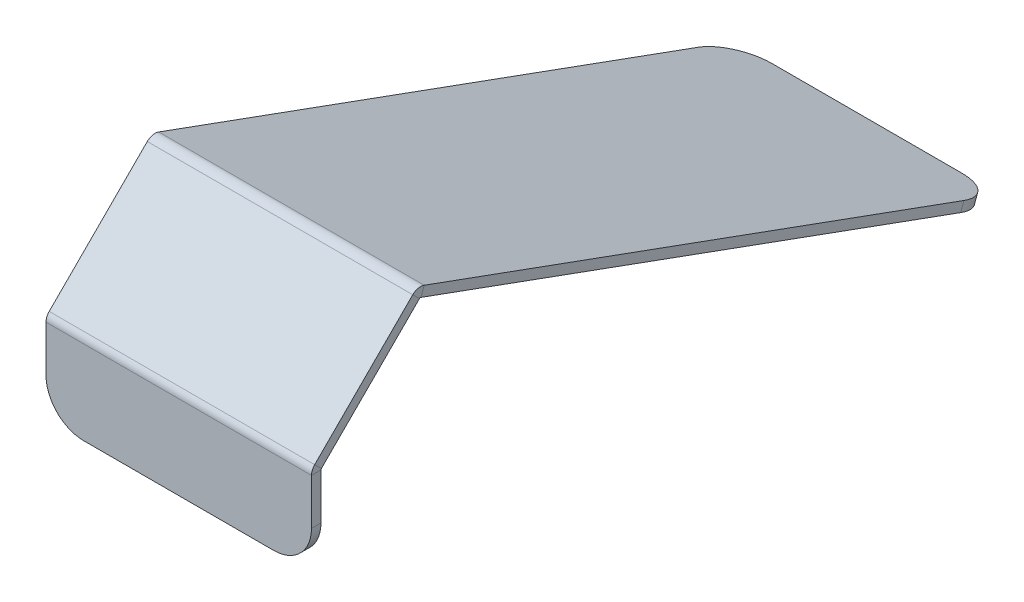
ISO-10303-21;
HEADER;
FILE_DESCRIPTION(('STEP AP214'),'2;1');
FILE_NAME('part.step','',(''),(''),'','','');
FILE_SCHEMA(('AUTOMOTIVE_DESIGN { 1 0 10303 214 1 1 1 1 }'));
ENDSEC;
DATA;
#1=APPLICATION_CONTEXT('core data for automotive mechanical design processes');
#2=APPLICATION_PROTOCOL_DEFINITION('international standard','automotive_design',2000,#1);
#3=PRODUCT_CONTEXT('',#1,'mechanical');
#4=PRODUCT('Part','Part','',(#3));
#5=PRODUCT_RELATED_PRODUCT_CATEGORY('part','',(#4));
#6=PRODUCT_DEFINITION_FORMATION('','',#4);
#7=PRODUCT_DEFINITION_CONTEXT('part definition',#1,'design');
#8=PRODUCT_DEFINITION('design','',#6,#7);
#9=PRODUCT_DEFINITION_SHAPE('','',#8);
#10=(LENGTH_UNIT() NAMED_UNIT(*) SI_UNIT(.MILLI.,.METRE.));
#11=(NAMED_UNIT(*) PLANE_ANGLE_UNIT() SI_UNIT($,.RADIAN.));
#12=(NAMED_UNIT(*) SI_UNIT($,.STERADIAN.) SOLID_ANGLE_UNIT());
#13=UNCERTAINTY_MEASURE_WITH_UNIT(LENGTH_MEASURE(1.E-05),#10,'distance_accuracy_value','');
#14=(GEOMETRIC_REPRESENTATION_CONTEXT(3) GLOBAL_UNCERTAINTY_ASSIGNED_CONTEXT((#13)) GLOBAL_UNIT_ASSIGNED_CONTEXT((#10,
#11,#12)) REPRESENTATION_CONTEXT('',''));
#15=CARTESIAN_POINT('',(0.,0.,0.));
#16=DIRECTION('',(0.,0.,1.));
#17=DIRECTION('',(1.,0.,0.));
#18=AXIS2_PLACEMENT_3D('',#15,#16,#17);
#19=CARTESIAN_POINT('',(-70.,330.936458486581,-279.331290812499));
#20=DIRECTION('',(1.,0.,0.));
#21=DIRECTION('',(0.,0.707106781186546,-0.707106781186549));
#22=AXIS2_PLACEMENT_3D('',#19,#20,#21);
#23=PLANE('',#22);
#24=DIRECTION('',(0.,-0.707106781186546,0.707106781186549));
#25=VECTOR('',#24,1.);
#26=CARTESIAN_POINT('',(-70.,330.936458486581,-279.331290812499));
#27=LINE('',#26,#25);
#28=CARTESIAN_POINT('',(-70.,100.020207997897,-48.4150402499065));
#29=VERTEX_POINT('',#28);
#30=CARTESIAN_POINT('',(-70.,48.2853789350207,3.31978878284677));
#31=VERTEX_POINT('',#30);
#32=EDGE_CURVE('E266',#29,#31,#27,.T.);
#33=ORIENTED_EDGE('',*,*,#32,.F.);
#34=DIRECTION('',(0.,-0.707106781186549,-0.707106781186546));
#35=VECTOR('',#34,1.);
#36=CARTESIAN_POINT('',(-70.,100.020207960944,-48.4150402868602));
#37=LINE('',#36,#35);
#38=CARTESIAN_POINT('',(-70.,96.4846740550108,-51.950574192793));
#39=VERTEX_POINT('',#38);
#40=EDGE_CURVE('E258',#29,#39,#37,.T.);
#41=ORIENTED_EDGE('',*,*,#40,.T.);
#42=DIRECTION('',(0.,-0.707106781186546,0.707106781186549));
#43=VECTOR('',#42,1.);
#44=CARTESIAN_POINT('',(-70.,327.400924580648,-282.866824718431));
#45=LINE('',#44,#43);
#46=CARTESIAN_POINT('',(-70.,44.7498450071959,-0.215745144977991));
#47=VERTEX_POINT('',#46);
#48=EDGE_CURVE('E216',#39,#47,#45,.T.);
#49=ORIENTED_EDGE('',*,*,#48,.T.);
#50=DIRECTION('',(0.,0.707106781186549,0.707106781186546));
#51=VECTOR('',#50,1.);
#52=CARTESIAN_POINT('',(-70.,48.2853789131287,3.31978876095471));
#53=LINE('',#52,#51);
#54=EDGE_CURVE('E241',#47,#31,#53,.T.);
#55=ORIENTED_EDGE('',*,*,#54,.T.);
#56=EDGE_LOOP('',(#33,#41,#49,#55));
#57=FACE_BOUND('',#56,.T.);
#58=ADVANCED_FACE('F40',(#57),#23,.F.);
#59=CARTESIAN_POINT('',(70.,330.936458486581,-279.331290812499));
#60=DIRECTION('',(-1.,0.,0.));
#61=DIRECTION('',(0.,-0.707106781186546,0.707106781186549));
#62=AXIS2_PLACEMENT_3D('',#59,#60,#61);
#63=PLANE('',#62);
#64=DIRECTION('',(0.,0.707106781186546,-0.707106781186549));
#65=VECTOR('',#64,1.);
#66=CARTESIAN_POINT('',(70.,327.400924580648,-282.866824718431));
#67=LINE('',#66,#65);
#68=CARTESIAN_POINT('',(70.,44.7498450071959,-0.215745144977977));
#69=VERTEX_POINT('',#68);
#70=CARTESIAN_POINT('',(70.,96.4846741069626,-51.9505741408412));
#71=VERTEX_POINT('',#70);
#72=EDGE_CURVE('E263',#69,#71,#67,.T.);
#73=ORIENTED_EDGE('',*,*,#72,.T.);
#74=DIRECTION('',(0.,0.707106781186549,0.707106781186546));
#75=VECTOR('',#74,1.);
#76=CARTESIAN_POINT('',(70.,100.020207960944,-48.4150402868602));
#77=LINE('',#76,#75);
#78=CARTESIAN_POINT('',(70.,100.020208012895,-48.4150402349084));
#79=VERTEX_POINT('',#78);
#80=EDGE_CURVE('E252',#71,#79,#77,.T.);
#81=ORIENTED_EDGE('',*,*,#80,.T.);
#82=DIRECTION('',(0.,0.707106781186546,-0.707106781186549));
#83=VECTOR('',#82,1.);
#84=CARTESIAN_POINT('',(70.,330.936458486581,-279.331290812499));
#85=LINE('',#84,#83);
#86=CARTESIAN_POINT('',(70.,48.2853789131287,3.31978876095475));
#87=VERTEX_POINT('',#86);
#88=EDGE_CURVE('E242',#87,#79,#85,.T.);
#89=ORIENTED_EDGE('',*,*,#88,.F.);
#90=DIRECTION('',(0.,-0.707106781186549,-0.707106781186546));
#91=VECTOR('',#90,1.);
#92=CARTESIAN_POINT('',(70.,48.2853789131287,3.31978876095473));
#93=LINE('',#92,#91);
#94=EDGE_CURVE('E248',#87,#69,#93,.T.);
#95=ORIENTED_EDGE('',*,*,#94,.T.);
#96=EDGE_LOOP('',(#73,#81,#89,#95));
#97=FACE_BOUND('',#96,.T.);
#98=ADVANCED_FACE('F339',(#97),#63,.F.);
#99=CARTESIAN_POINT('',(-70.,11.6777467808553,32.8563530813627));
#100=DIRECTION('',(0.,0.707106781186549,0.707106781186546));
#101=DIRECTION('',(1.,0.,0.));
#102=AXIS2_PLACEMENT_3D('',#99,#100,#101);
#103=PLANE('',#102);
#104=ORIENTED_EDGE('',*,*,#48,.F.);
#105=DIRECTION('',(1.,0.,0.));
#106=VECTOR('',#105,1.);
#107=CARTESIAN_POINT('',(-70.,96.4846740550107,-51.950574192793));
#108=LINE('',#107,#106);
#109=EDGE_CURVE('E255',#39,#71,#108,.T.);
#110=ORIENTED_EDGE('',*,*,#109,.T.);
#111=ORIENTED_EDGE('',*,*,#72,.F.);
#112=DIRECTION('',(-1.,0.,0.));
#113=VECTOR('',#112,1.);
#114=CARTESIAN_POINT('',(-70.,44.7498450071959,-0.215745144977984));
#115=LINE('',#114,#113);
#116=EDGE_CURVE('E245',#69,#47,#115,.T.);
#117=ORIENTED_EDGE('',*,*,#116,.T.);
#118=EDGE_LOOP('',(#104,#110,#111,#117));
#119=FACE_BOUND('',#118,.T.);
#120=ADVANCED_FACE('F358',(#119),#103,.F.);
#121=CARTESIAN_POINT('',(-70.,15.2132806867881,36.3918869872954));
#122=DIRECTION('',(0.,0.707106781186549,0.707106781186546));
#123=DIRECTION('',(1.,0.,0.));
#124=AXIS2_PLACEMENT_3D('',#121,#122,#123);
#125=PLANE('',#124);
#126=DIRECTION('',(1.,0.,0.));
#127=VECTOR('',#126,1.);
#128=CARTESIAN_POINT('',(-70.,100.020207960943,-48.4150402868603));
#129=LINE('',#128,#127);
#130=EDGE_CURVE('E191',#29,#79,#129,.T.);
#131=ORIENTED_EDGE('',*,*,#130,.F.);
#132=ORIENTED_EDGE('',*,*,#32,.T.);
#133=DIRECTION('',(-1.,0.,0.));
#134=VECTOR('',#133,1.);
#135=CARTESIAN_POINT('',(-70.,48.2853789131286,3.31978876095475));
#136=LINE('',#135,#134);
#137=EDGE_CURVE('E238',#87,#31,#136,.T.);
#138=ORIENTED_EDGE('',*,*,#137,.F.);
#139=ORIENTED_EDGE('',*,*,#88,.T.);
#140=EDGE_LOOP('',(#131,#132,#138,#139));
#141=FACE_BOUND('',#140,.T.);
#142=ADVANCED_FACE('F336',(#141),#125,.T.);
#143=CARTESIAN_POINT('',(-70.,0.,5.));
#144=DIRECTION('',(0.,1.,0.));
#145=DIRECTION('',(0.,0.,1.));
#146=AXIS2_PLACEMENT_3D('',#143,#144,#145);
#147=PLANE('',#146);
#148=DIRECTION('',(1.,0.,0.));
#149=VECTOR('',#148,1.);
#150=CARTESIAN_POINT('',(-70.,0.,0.));
#151=LINE('',#150,#149);
#152=CARTESIAN_POINT('',(-50.,0.,0.));
#153=VERTEX_POINT('',#152);
#154=CARTESIAN_POINT('',(50.,0.,0.));
#155=VERTEX_POINT('',#154);
#156=EDGE_CURVE('E228',#153,#155,#151,.T.);
#157=ORIENTED_EDGE('',*,*,#156,.T.);
#158=DIRECTION('',(0.,0.,-1.));
#159=VECTOR('',#158,1.);
#160=CARTESIAN_POINT('',(50.,0.,5.));
#161=LINE('',#160,#159);
#162=CARTESIAN_POINT('',(50.,0.,5.));
#163=VERTEX_POINT('',#162);
#164=EDGE_CURVE('E61',#155,#163,#161,.F.);
#165=ORIENTED_EDGE('',*,*,#164,.T.);
#166=DIRECTION('',(1.,0.,0.));
#167=VECTOR('',#166,1.);
#168=CARTESIAN_POINT('',(-70.,0.,5.));
#169=LINE('',#168,#167);
#170=CARTESIAN_POINT('',(-50.,0.,5.));
#171=VERTEX_POINT('',#170);
#172=EDGE_CURVE('E219',#171,#163,#169,.T.);
#173=ORIENTED_EDGE('',*,*,#172,.F.);
#174=DIRECTION('',(0.,0.,-1.));
#175=VECTOR('',#174,1.);
#176=CARTESIAN_POINT('',(-50.,0.,5.));
#177=LINE('',#176,#175);
#178=EDGE_CURVE('E292',#171,#153,#177,.T.);
#179=ORIENTED_EDGE('',*,*,#178,.T.);
#180=EDGE_LOOP('',(#157,#165,#173,#179));
#181=FACE_BOUND('',#180,.T.);
#182=ADVANCED_FACE('F313',(#181),#147,.F.);
#183=CARTESIAN_POINT('',(-70.,0.,5.));
#184=DIRECTION('',(0.,0.,1.));
#185=DIRECTION('',(1.,0.,0.));
#186=AXIS2_PLACEMENT_3D('',#183,#184,#185);
#187=PLANE('',#186);
#188=ORIENTED_EDGE('',*,*,#172,.T.);
#189=CARTESIAN_POINT('',(50.,20.,5.));
#190=DIRECTION('',(0.,0.,1.));
#191=DIRECTION('',(1.,0.,0.));
#192=AXIS2_PLACEMENT_3D('',#189,#190,#191);
#193=CIRCLE('',#192,20.);
#194=CARTESIAN_POINT('',(70.,20.,5.));
#195=VERTEX_POINT('',#194);
#196=EDGE_CURVE('E48',#163,#195,#193,.T.);
#197=ORIENTED_EDGE('',*,*,#196,.T.);
#198=DIRECTION('',(0.,1.,0.));
#199=VECTOR('',#198,1.);
#200=CARTESIAN_POINT('',(69.9999999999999,446.5,5.));
#201=LINE('',#200,#199);
#202=CARTESIAN_POINT('',(70.,44.2289901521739,5.));
#203=VERTEX_POINT('',#202);
#204=EDGE_CURVE('E226',#195,#203,#201,.T.);
#205=ORIENTED_EDGE('',*,*,#204,.T.);
#206=DIRECTION('',(-1.,0.,0.));
#207=VECTOR('',#206,1.);
#208=CARTESIAN_POINT('',(-70.,44.2289901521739,5.));
#209=LINE('',#208,#207);
#210=CARTESIAN_POINT('',(-70.,44.2289901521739,5.00000003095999));
#211=VERTEX_POINT('',#210);
#212=EDGE_CURVE('E223',#203,#211,#209,.T.);
#213=ORIENTED_EDGE('',*,*,#212,.T.);
#214=DIRECTION('',(0.,-1.,0.));
#215=VECTOR('',#214,1.);
#216=CARTESIAN_POINT('',(-70.0000000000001,446.5,5.));
#217=LINE('',#216,#215);
#218=CARTESIAN_POINT('',(-70.,20.,5.));
#219=VERTEX_POINT('',#218);
#220=EDGE_CURVE('E221',#211,#219,#217,.T.);
#221=ORIENTED_EDGE('',*,*,#220,.T.);
#222=CARTESIAN_POINT('',(-50.,20.,5.));
#223=DIRECTION('',(0.,0.,1.));
#224=DIRECTION('',(1.,0.,0.));
#225=AXIS2_PLACEMENT_3D('',#222,#223,#224);
#226=CIRCLE('',#225,20.);
#227=EDGE_CURVE('E296',#219,#171,#226,.T.);
#228=ORIENTED_EDGE('',*,*,#227,.T.);
#229=EDGE_LOOP('',(#188,#197,#205,#213,#221,#228));
#230=FACE_BOUND('',#229,.T.);
#231=ADVANCED_FACE('F300',(#230),#187,.T.);
#232=CARTESIAN_POINT('',(-70.0000000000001,446.5,5.));
#233=DIRECTION('',(1.,0.,0.));
#234=DIRECTION('',(0.,1.,0.));
#235=AXIS2_PLACEMENT_3D('',#232,#233,#234);
#236=PLANE('',#235);
#237=DIRECTION('',(0.,-1.,0.));
#238=VECTOR('',#237,1.);
#239=CARTESIAN_POINT('',(-70.0000000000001,446.5,0.));
#240=LINE('',#239,#238);
#241=CARTESIAN_POINT('',(-70.,44.2289901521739,0.));
#242=VERTEX_POINT('',#241);
#243=CARTESIAN_POINT('',(-70.,20.,0.));
#244=VERTEX_POINT('',#243);
#245=EDGE_CURVE('E217',#242,#244,#240,.T.);
#246=ORIENTED_EDGE('',*,*,#245,.T.);
#247=DIRECTION('',(0.,0.,-1.));
#248=VECTOR('',#247,1.);
#249=CARTESIAN_POINT('',(-70.,20.,5.));
#250=LINE('',#249,#248);
#251=EDGE_CURVE('E12',#244,#219,#250,.F.);
#252=ORIENTED_EDGE('',*,*,#251,.T.);
#253=ORIENTED_EDGE('',*,*,#220,.F.);
#254=DIRECTION('',(0.,0.,1.));
#255=VECTOR('',#254,1.);
#256=CARTESIAN_POINT('',(-70.,44.2289901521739,5.));
#257=LINE('',#256,#255);
#258=EDGE_CURVE('E230',#242,#211,#257,.T.);
#259=ORIENTED_EDGE('',*,*,#258,.F.);
#260=EDGE_LOOP('',(#246,#252,#253,#259));
#261=FACE_BOUND('',#260,.T.);
#262=ADVANCED_FACE('F318',(#261),#236,.F.);
#263=CARTESIAN_POINT('',(-70.,0.,0.));
#264=DIRECTION('',(0.,0.,1.));
#265=DIRECTION('',(1.,0.,0.));
#266=AXIS2_PLACEMENT_3D('',#263,#264,#265);
#267=PLANE('',#266);
#268=DIRECTION('',(0.,1.,0.));
#269=VECTOR('',#268,1.);
#270=CARTESIAN_POINT('',(69.9999999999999,446.5,0.));
#271=LINE('',#270,#269);
#272=CARTESIAN_POINT('',(70.,20.,0.));
#273=VERTEX_POINT('',#272);
#274=CARTESIAN_POINT('',(70.,44.2289901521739,0.));
#275=VERTEX_POINT('',#274);
#276=EDGE_CURVE('E214',#273,#275,#271,.T.);
#277=ORIENTED_EDGE('',*,*,#276,.F.);
#278=CARTESIAN_POINT('',(50.,20.,0.));
#279=DIRECTION('',(0.,0.,1.));
#280=DIRECTION('',(1.,0.,0.));
#281=AXIS2_PLACEMENT_3D('',#278,#279,#280);
#282=CIRCLE('',#281,20.);
#283=EDGE_CURVE('E290',#273,#155,#282,.F.);
#284=ORIENTED_EDGE('',*,*,#283,.T.);
#285=ORIENTED_EDGE('',*,*,#156,.F.);
#286=CARTESIAN_POINT('',(-50.,20.,0.));
#287=DIRECTION('',(0.,0.,1.));
#288=DIRECTION('',(1.,0.,0.));
#289=AXIS2_PLACEMENT_3D('',#286,#287,#288);
#290=CIRCLE('',#289,20.);
#291=EDGE_CURVE('E288',#153,#244,#290,.F.);
#292=ORIENTED_EDGE('',*,*,#291,.T.);
#293=ORIENTED_EDGE('',*,*,#245,.F.);
#294=DIRECTION('',(-1.,0.,0.));
#295=VECTOR('',#294,1.);
#296=CARTESIAN_POINT('',(-70.,44.2289901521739,0.));
#297=LINE('',#296,#295);
#298=EDGE_CURVE('E233',#275,#242,#297,.T.);
#299=ORIENTED_EDGE('',*,*,#298,.F.);
#300=EDGE_LOOP('',(#277,#284,#285,#292,#293,#299));
#301=FACE_BOUND('',#300,.T.);
#302=ADVANCED_FACE('F311',(#301),#267,.F.);
#303=CARTESIAN_POINT('',(69.9999999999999,446.5,5.));
#304=DIRECTION('',(-1.,0.,0.));
#305=DIRECTION('',(0.,-1.,0.));
#306=AXIS2_PLACEMENT_3D('',#303,#304,#305);
#307=PLANE('',#306);
#308=ORIENTED_EDGE('',*,*,#204,.F.);
#309=DIRECTION('',(0.,0.,-1.));
#310=VECTOR('',#309,1.);
#311=CARTESIAN_POINT('',(70.,20.,5.));
#312=LINE('',#311,#310);
#313=EDGE_CURVE('E285',#195,#273,#312,.T.);
#314=ORIENTED_EDGE('',*,*,#313,.T.);
#315=ORIENTED_EDGE('',*,*,#276,.T.);
#316=DIRECTION('',(0.,0.,-1.));
#317=VECTOR('',#316,1.);
#318=CARTESIAN_POINT('',(70.,44.2289901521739,5.));
#319=LINE('',#318,#317);
#320=EDGE_CURVE('E210',#203,#275,#319,.T.);
#321=ORIENTED_EDGE('',*,*,#320,.F.);
#322=EDGE_LOOP('',(#308,#314,#315,#321));
#323=FACE_BOUND('',#322,.T.);
#324=ADVANCED_FACE('F305',(#323),#307,.F.);
#325=CARTESIAN_POINT('',(70.,44.2289901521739,-0.736600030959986));
#326=DIRECTION('',(1.,0.,0.));
#327=DIRECTION('',(0.,0.,-1.));
#328=AXIS2_PLACEMENT_3D('',#325,#326,#327);
#329=PLANE('',#328);
#330=ORIENTED_EDGE('',*,*,#320,.T.);
#331=CARTESIAN_POINT('',(70.0000000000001,44.2289901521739,-0.7366));
#332=DIRECTION('',(-1.,0.,0.));
#333=DIRECTION('',(0.,-1.,0.));
#334=AXIS2_PLACEMENT_3D('',#331,#332,#333);
#335=CIRCLE('',#334,0.736600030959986);
#336=EDGE_CURVE('E192',#275,#69,#335,.T.);
#337=ORIENTED_EDGE('',*,*,#336,.T.);
#338=ORIENTED_EDGE('',*,*,#94,.F.);
#339=CARTESIAN_POINT('',(70.,44.2289901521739,-0.736600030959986));
#340=DIRECTION('',(-1.,0.,0.));
#341=DIRECTION('',(0.,0.,1.));
#342=AXIS2_PLACEMENT_3D('',#339,#340,#341);
#343=CIRCLE('',#342,5.73660005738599);
#344=EDGE_CURVE('E205',#203,#87,#343,.T.);
#345=ORIENTED_EDGE('',*,*,#344,.F.);
#346=EDGE_LOOP('',(#330,#337,#338,#345));
#347=FACE_BOUND('',#346,.T.);
#348=ADVANCED_FACE('F341',(#347),#329,.T.);
#349=CARTESIAN_POINT('',(-70.,44.2289901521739,-0.736600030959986));
#350=DIRECTION('',(-1.,0.,0.));
#351=DIRECTION('',(0.,0.,1.));
#352=AXIS2_PLACEMENT_3D('',#349,#350,#351);
#353=PLANE('',#352);
#354=CARTESIAN_POINT('',(-69.9999999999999,44.2289901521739,-0.7366));
#355=DIRECTION('',(-1.,0.,0.));
#356=DIRECTION('',(0.,-1.,0.));
#357=AXIS2_PLACEMENT_3D('',#354,#355,#356);
#358=CIRCLE('',#357,0.736600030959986);
#359=EDGE_CURVE('E196',#47,#242,#358,.F.);
#360=ORIENTED_EDGE('',*,*,#359,.T.);
#361=ORIENTED_EDGE('',*,*,#258,.T.);
#362=CARTESIAN_POINT('',(-70.,44.2289901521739,-0.736600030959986));
#363=DIRECTION('',(1.,0.,0.));
#364=DIRECTION('',(0.,0.,-1.));
#365=AXIS2_PLACEMENT_3D('',#362,#363,#364);
#366=CIRCLE('',#365,5.73660005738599);
#367=EDGE_CURVE('E208',#31,#211,#366,.T.);
#368=ORIENTED_EDGE('',*,*,#367,.F.);
#369=ORIENTED_EDGE('',*,*,#54,.F.);
#370=EDGE_LOOP('',(#360,#361,#368,#369));
#371=FACE_BOUND('',#370,.T.);
#372=ADVANCED_FACE('F327',(#371),#353,.T.);
#373=CARTESIAN_POINT('',(140.112318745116,44.2289901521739,-0.7366));
#374=DIRECTION('',(-1.,0.,0.));
#375=DIRECTION('',(0.,-1.,0.));
#376=AXIS2_PLACEMENT_3D('',#373,#374,#375);
#377=CYLINDRICAL_SURFACE('',#376,5.73660003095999);
#378=ORIENTED_EDGE('',*,*,#137,.T.);
#379=ORIENTED_EDGE('',*,*,#367,.T.);
#380=ORIENTED_EDGE('',*,*,#212,.F.);
#381=ORIENTED_EDGE('',*,*,#344,.T.);
#382=EDGE_LOOP('',(#378,#379,#380,#381));
#383=FACE_BOUND('',#382,.T.);
#384=ADVANCED_FACE('F332',(#383),#377,.T.);
#385=CARTESIAN_POINT('',(140.112318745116,44.2289901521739,-0.7366));
#386=DIRECTION('',(-1.,0.,0.));
#387=DIRECTION('',(0.,-1.,0.));
#388=AXIS2_PLACEMENT_3D('',#385,#386,#387);
#389=CYLINDRICAL_SURFACE('',#388,0.736600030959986);
#390=ORIENTED_EDGE('',*,*,#116,.F.);
#391=ORIENTED_EDGE('',*,*,#336,.F.);
#392=ORIENTED_EDGE('',*,*,#298,.T.);
#393=ORIENTED_EDGE('',*,*,#359,.F.);
#394=EDGE_LOOP('',(#390,#391,#392,#393));
#395=FACE_BOUND('',#394,.T.);
#396=ADVANCED_FACE('F325',(#395),#389,.F.);
#397=CARTESIAN_POINT('',(-70.,95.9638191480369,-52.4714290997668));
#398=DIRECTION('',(-1.,0.,0.));
#399=DIRECTION('',(0.,0.,1.));
#400=AXIS2_PLACEMENT_3D('',#397,#398,#399);
#401=PLANE('',#400);
#402=DIRECTION('',(0.,-0.939692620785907,0.342020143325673));
#403=VECTOR('',#402,1.);
#404=CARTESIAN_POINT('',(-70.,101.354459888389,-54.433461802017));
#405=LINE('',#404,#403);
#406=CARTESIAN_POINT('',(-70.,101.354459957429,-54.4334618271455));
#407=VERTEX_POINT('',#406);
#408=CARTESIAN_POINT('',(-70.,96.6559967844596,-52.7233610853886));
#409=VERTEX_POINT('',#408);
#410=EDGE_CURVE('E606',#407,#409,#405,.T.);
#411=ORIENTED_EDGE('',*,*,#410,.T.);
#412=CARTESIAN_POINT('',(-70.,95.9638191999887,-52.471429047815));
#413=DIRECTION('',(-1.,0.,0.));
#414=DIRECTION('',(0.,0.,1.));
#415=AXIS2_PLACEMENT_3D('',#412,#413,#414);
#416=CIRCLE('',#415,0.736600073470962);
#417=EDGE_CURVE('E201',#409,#39,#416,.F.);
#418=ORIENTED_EDGE('',*,*,#417,.T.);
#419=ORIENTED_EDGE('',*,*,#40,.F.);
#420=CARTESIAN_POINT('',(-70.,95.9638191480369,-52.4714290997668));
#421=DIRECTION('',(1.,0.,0.));
#422=DIRECTION('',(0.,0.,-1.));
#423=AXIS2_PLACEMENT_3D('',#420,#421,#422);
#424=CIRCLE('',#423,5.73660012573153);
#425=EDGE_CURVE('E193',#407,#29,#424,.T.);
#426=ORIENTED_EDGE('',*,*,#425,.F.);
#427=EDGE_LOOP('',(#411,#418,#419,#426));
#428=FACE_BOUND('',#427,.T.);
#429=ADVANCED_FACE('F507',(#428),#401,.T.);
#430=CARTESIAN_POINT('',(70.,95.9638191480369,-52.4714290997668));
#431=DIRECTION('',(1.,0.,0.));
#432=DIRECTION('',(0.,0.,-1.));
#433=AXIS2_PLACEMENT_3D('',#430,#431,#432);
#434=PLANE('',#433);
#435=CARTESIAN_POINT('',(70.,95.9638191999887,-52.471429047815));
#436=DIRECTION('',(-1.,0.,0.));
#437=DIRECTION('',(0.,0.,1.));
#438=AXIS2_PLACEMENT_3D('',#435,#436,#437);
#439=CIRCLE('',#438,0.736600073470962);
#440=CARTESIAN_POINT('',(70.,96.6559967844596,-52.7233610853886));
#441=VERTEX_POINT('',#440);
#442=EDGE_CURVE('E185',#71,#441,#439,.T.);
#443=ORIENTED_EDGE('',*,*,#442,.T.);
#444=DIRECTION('',(0.,0.939692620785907,-0.342020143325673));
#445=VECTOR('',#444,1.);
#446=CARTESIAN_POINT('',(70.,101.354459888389,-54.433461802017));
#447=LINE('',#446,#445);
#448=CARTESIAN_POINT('',(70.,101.354459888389,-54.433461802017));
#449=VERTEX_POINT('',#448);
#450=EDGE_CURVE('E172',#441,#449,#447,.T.);
#451=ORIENTED_EDGE('',*,*,#450,.T.);
#452=CARTESIAN_POINT('',(70.,95.9638191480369,-52.4714290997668));
#453=DIRECTION('',(-1.,0.,0.));
#454=DIRECTION('',(0.,0.,1.));
#455=AXIS2_PLACEMENT_3D('',#452,#453,#454);
#456=CIRCLE('',#455,5.73660012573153);
#457=EDGE_CURVE('E182',#79,#449,#456,.T.);
#458=ORIENTED_EDGE('',*,*,#457,.F.);
#459=ORIENTED_EDGE('',*,*,#80,.F.);
#460=EDGE_LOOP('',(#443,#451,#458,#459));
#461=FACE_BOUND('',#460,.T.);
#462=ADVANCED_FACE('F181',(#461),#434,.T.);
#463=CARTESIAN_POINT('',(140.268315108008,95.9638191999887,-52.471429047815));
#464=DIRECTION('',(-1.,0.,0.));
#465=DIRECTION('',(0.,0.,1.));
#466=AXIS2_PLACEMENT_3D('',#463,#464,#465);
#467=CYLINDRICAL_SURFACE('',#466,5.73660007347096);
#468=ORIENTED_EDGE('',*,*,#130,.T.);
#469=ORIENTED_EDGE('',*,*,#457,.T.);
#470=DIRECTION('',(1.,0.,0.));
#471=VECTOR('',#470,1.);
#472=CARTESIAN_POINT('',(-70.,101.354459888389,-54.433461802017));
#473=LINE('',#472,#471);
#474=EDGE_CURVE('E154',#407,#449,#473,.T.);
#475=ORIENTED_EDGE('',*,*,#474,.F.);
#476=ORIENTED_EDGE('',*,*,#425,.T.);
#477=EDGE_LOOP('',(#468,#469,#475,#476));
#478=FACE_BOUND('',#477,.T.);
#479=ADVANCED_FACE('F189',(#478),#467,.T.);
#480=CARTESIAN_POINT('',(140.268315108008,95.9638191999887,-52.471429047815));
#481=DIRECTION('',(-1.,0.,0.));
#482=DIRECTION('',(0.,0.,1.));
#483=AXIS2_PLACEMENT_3D('',#480,#481,#482);
#484=CYLINDRICAL_SURFACE('',#483,0.736600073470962);
#485=ORIENTED_EDGE('',*,*,#109,.F.);
#486=ORIENTED_EDGE('',*,*,#417,.F.);
#487=DIRECTION('',(1.,0.,0.));
#488=VECTOR('',#487,1.);
#489=CARTESIAN_POINT('',(-70.,96.6559967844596,-52.7233610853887));
#490=LINE('',#489,#488);
#491=EDGE_CURVE('E187',#409,#441,#490,.T.);
#492=ORIENTED_EDGE('',*,*,#491,.T.);
#493=ORIENTED_EDGE('',*,*,#442,.F.);
#494=EDGE_LOOP('',(#485,#486,#492,#493));
#495=FACE_BOUND('',#494,.T.);
#496=ADVANCED_FACE('F440',(#495),#484,.F.);
#497=CARTESIAN_POINT('',(-70.,-9.08148001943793,-357.853712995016));
#498=DIRECTION('',(0.,0.342020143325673,0.939692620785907));
#499=DIRECTION('',(0.,-0.939692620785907,0.342020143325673));
#500=AXIS2_PLACEMENT_3D('',#497,#498,#499);
#501=PLANE('',#500);
#502=DIRECTION('',(-1.,0.,0.));
#503=VECTOR('',#502,1.);
#504=CARTESIAN_POINT('',(-70.,-9.08148001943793,-357.853712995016));
#505=LINE('',#504,#503);
#506=CARTESIAN_POINT('',(50.,-9.08148001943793,-357.853712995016));
#507=VERTEX_POINT('',#506);
#508=CARTESIAN_POINT('',(-50.,-9.08148001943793,-357.853712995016));
#509=VERTEX_POINT('',#508);
#510=EDGE_CURVE('E176',#507,#509,#505,.T.);
#511=ORIENTED_EDGE('',*,*,#510,.F.);
#512=DIRECTION('',(0.,-0.939692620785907,0.342020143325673));
#513=VECTOR('',#512,1.);
#514=CARTESIAN_POINT('',(50.,-9.08148001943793,-357.853712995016));
#515=LINE('',#514,#513);
#516=CARTESIAN_POINT('',(50.,-13.7799431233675,-356.143612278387));
#517=VERTEX_POINT('',#516);
#518=EDGE_CURVE('E270',#507,#517,#515,.T.);
#519=ORIENTED_EDGE('',*,*,#518,.T.);
#520=DIRECTION('',(-1.,0.,0.));
#521=VECTOR('',#520,1.);
#522=CARTESIAN_POINT('',(-70.,-13.7799431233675,-356.143612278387));
#523=LINE('',#522,#521);
#524=CARTESIAN_POINT('',(-50.,-13.7799431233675,-356.143612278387));
#525=VERTEX_POINT('',#524);
#526=EDGE_CURVE('E186',#517,#525,#523,.T.);
#527=ORIENTED_EDGE('',*,*,#526,.T.);
#528=DIRECTION('',(0.,-0.939692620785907,0.342020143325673));
#529=VECTOR('',#528,1.);
#530=CARTESIAN_POINT('',(-50.,-9.08148001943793,-357.853712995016));
#531=LINE('',#530,#529);
#532=EDGE_CURVE('E261',#525,#509,#531,.F.);
#533=ORIENTED_EDGE('',*,*,#532,.T.);
#534=EDGE_LOOP('',(#511,#519,#527,#533));
#535=FACE_BOUND('',#534,.T.);
#536=ADVANCED_FACE('F430',(#535),#501,.F.);
#537=CARTESIAN_POINT('',(-70.,143.630513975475,61.719042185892));
#538=DIRECTION('',(0.,0.939692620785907,-0.342020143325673));
#539=DIRECTION('',(1.,0.,0.));
#540=AXIS2_PLACEMENT_3D('',#537,#538,#539);
#541=PLANE('',#540);
#542=DIRECTION('',(0.,-0.342020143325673,-0.939692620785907));
#543=VECTOR('',#542,1.);
#544=CARTESIAN_POINT('',(70.,-9.08148001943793,-357.853712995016));
#545=LINE('',#544,#543);
#546=CARTESIAN_POINT('',(70.,-2.24107715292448,-339.059860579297));
#547=VERTEX_POINT('',#546);
#548=EDGE_CURVE('E157',#449,#547,#545,.T.);
#549=ORIENTED_EDGE('',*,*,#548,.T.);
#550=CARTESIAN_POINT('',(50.,-2.24107715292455,-339.059860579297));
#551=DIRECTION('',(0.,0.939692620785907,-0.342020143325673));
#552=DIRECTION('',(0.,0.342020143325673,0.939692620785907));
#553=AXIS2_PLACEMENT_3D('',#550,#551,#552);
#554=CIRCLE('',#553,20.);
#555=EDGE_CURVE('E280',#547,#507,#554,.T.);
#556=ORIENTED_EDGE('',*,*,#555,.T.);
#557=ORIENTED_EDGE('',*,*,#510,.T.);
#558=CARTESIAN_POINT('',(-50.,-2.24107715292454,-339.059860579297));
#559=DIRECTION('',(0.,0.939692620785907,-0.342020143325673));
#560=DIRECTION('',(0.,0.342020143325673,0.939692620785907));
#561=AXIS2_PLACEMENT_3D('',#558,#559,#560);
#562=CIRCLE('',#561,20.);
#563=CARTESIAN_POINT('',(-70.,-2.24107715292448,-339.059860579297));
#564=VERTEX_POINT('',#563);
#565=EDGE_CURVE('E278',#509,#564,#562,.T.);
#566=ORIENTED_EDGE('',*,*,#565,.T.);
#567=DIRECTION('',(0.,0.342020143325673,0.939692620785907));
#568=VECTOR('',#567,1.);
#569=CARTESIAN_POINT('',(-70.,-9.08148001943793,-357.853712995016));
#570=LINE('',#569,#568);
#571=EDGE_CURVE('E160',#564,#407,#570,.T.);
#572=ORIENTED_EDGE('',*,*,#571,.T.);
#573=ORIENTED_EDGE('',*,*,#474,.T.);
#574=EDGE_LOOP('',(#549,#556,#557,#566,#572,#573));
#575=FACE_BOUND('',#574,.T.);
#576=ADVANCED_FACE('F156',(#575),#541,.T.);
#577=CARTESIAN_POINT('',(70.,-9.08148001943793,-357.853712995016));
#578=DIRECTION('',(-1.,0.,0.));
#579=DIRECTION('',(0.,0.342020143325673,0.939692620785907));
#580=AXIS2_PLACEMENT_3D('',#577,#578,#579);
#581=PLANE('',#580);
#582=DIRECTION('',(0.,-0.342020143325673,-0.939692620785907));
#583=VECTOR('',#582,1.);
#584=CARTESIAN_POINT('',(70.,-13.7799431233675,-356.143612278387));
#585=LINE('',#584,#583);
#586=CARTESIAN_POINT('',(70.,-6.93954025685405,-337.349759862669));
#587=VERTEX_POINT('',#586);
#588=EDGE_CURVE('E616',#441,#587,#585,.T.);
#589=ORIENTED_EDGE('',*,*,#588,.T.);
#590=DIRECTION('',(0.,-0.939692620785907,0.342020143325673));
#591=VECTOR('',#590,1.);
#592=CARTESIAN_POINT('',(70.,-2.24107715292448,-339.059860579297));
#593=LINE('',#592,#591);
#594=EDGE_CURVE('E175',#587,#547,#593,.F.);
#595=ORIENTED_EDGE('',*,*,#594,.T.);
#596=ORIENTED_EDGE('',*,*,#548,.F.);
#597=ORIENTED_EDGE('',*,*,#450,.F.);
#598=EDGE_LOOP('',(#589,#595,#596,#597));
#599=FACE_BOUND('',#598,.T.);
#600=ADVANCED_FACE('F171',(#599),#581,.F.);
#601=CARTESIAN_POINT('',(-70.,138.932050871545,63.4291429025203));
#602=DIRECTION('',(0.,0.939692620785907,-0.342020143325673));
#603=DIRECTION('',(1.,0.,0.));
#604=AXIS2_PLACEMENT_3D('',#601,#602,#603);
#605=PLANE('',#604);
#606=ORIENTED_EDGE('',*,*,#526,.F.);
#607=CARTESIAN_POINT('',(50.,-6.93954025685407,-337.349759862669));
#608=DIRECTION('',(0.,0.939692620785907,-0.342020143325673));
#609=DIRECTION('',(0.,0.342020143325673,0.939692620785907));
#610=AXIS2_PLACEMENT_3D('',#607,#608,#609);
#611=CIRCLE('',#610,20.);
#612=EDGE_CURVE('E275',#517,#587,#611,.F.);
#613=ORIENTED_EDGE('',*,*,#612,.T.);
#614=ORIENTED_EDGE('',*,*,#588,.F.);
#615=ORIENTED_EDGE('',*,*,#491,.F.);
#616=DIRECTION('',(0.,0.342020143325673,0.939692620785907));
#617=VECTOR('',#616,1.);
#618=CARTESIAN_POINT('',(-70.,-13.7799431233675,-356.143612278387));
#619=LINE('',#618,#617);
#620=CARTESIAN_POINT('',(-70.,-6.93954025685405,-337.349759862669));
#621=VERTEX_POINT('',#620);
#622=EDGE_CURVE('E203',#621,#409,#619,.T.);
#623=ORIENTED_EDGE('',*,*,#622,.F.);
#624=CARTESIAN_POINT('',(-50.,-6.93954025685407,-337.349759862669));
#625=DIRECTION('',(0.,0.939692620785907,-0.342020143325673));
#626=DIRECTION('',(0.,0.342020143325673,0.939692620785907));
#627=AXIS2_PLACEMENT_3D('',#624,#625,#626);
#628=CIRCLE('',#627,20.);
#629=EDGE_CURVE('E273',#621,#525,#628,.F.);
#630=ORIENTED_EDGE('',*,*,#629,.T.);
#631=EDGE_LOOP('',(#606,#613,#614,#615,#623,#630));
#632=FACE_BOUND('',#631,.T.);
#633=ADVANCED_FACE('F402',(#632),#605,.F.);
#634=CARTESIAN_POINT('',(-70.,-9.08148001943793,-357.853712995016));
#635=DIRECTION('',(1.,0.,0.));
#636=DIRECTION('',(0.,-0.342020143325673,-0.939692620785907));
#637=AXIS2_PLACEMENT_3D('',#634,#635,#636);
#638=PLANE('',#637);
#639=ORIENTED_EDGE('',*,*,#571,.F.);
#640=DIRECTION('',(0.,-0.939692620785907,0.342020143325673));
#641=VECTOR('',#640,1.);
#642=CARTESIAN_POINT('',(-70.,-2.24107715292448,-339.059860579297));
#643=LINE('',#642,#641);
#644=EDGE_CURVE('E282',#564,#621,#643,.T.);
#645=ORIENTED_EDGE('',*,*,#644,.T.);
#646=ORIENTED_EDGE('',*,*,#622,.T.);
#647=ORIENTED_EDGE('',*,*,#410,.F.);
#648=EDGE_LOOP('',(#639,#645,#646,#647));
#649=FACE_BOUND('',#648,.T.);
#650=ADVANCED_FACE('F366',(#649),#638,.F.);
#651=CARTESIAN_POINT('',(50.,-2.24107715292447,-339.059860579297));
#652=DIRECTION('',(0.,-0.939692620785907,0.342020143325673));
#653=DIRECTION('',(0.,-0.342020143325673,-0.939692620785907));
#654=AXIS2_PLACEMENT_3D('',#651,#652,#653);
#655=CYLINDRICAL_SURFACE('',#654,20.);
#656=ORIENTED_EDGE('',*,*,#555,.F.);
#657=ORIENTED_EDGE('',*,*,#594,.F.);
#658=ORIENTED_EDGE('',*,*,#612,.F.);
#659=ORIENTED_EDGE('',*,*,#518,.F.);
#660=EDGE_LOOP('',(#656,#657,#658,#659));
#661=FACE_BOUND('',#660,.T.);
#662=ADVANCED_FACE('F362',(#661),#655,.T.);
#663=CARTESIAN_POINT('',(-50.,-2.24107715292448,-339.059860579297));
#664=DIRECTION('',(0.,-0.939692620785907,0.342020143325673));
#665=DIRECTION('',(0.,-0.342020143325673,-0.939692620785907));
#666=AXIS2_PLACEMENT_3D('',#663,#664,#665);
#667=CYLINDRICAL_SURFACE('',#666,20.);
#668=ORIENTED_EDGE('',*,*,#565,.F.);
#669=ORIENTED_EDGE('',*,*,#532,.F.);
#670=ORIENTED_EDGE('',*,*,#629,.F.);
#671=ORIENTED_EDGE('',*,*,#644,.F.);
#672=EDGE_LOOP('',(#668,#669,#670,#671));
#673=FACE_BOUND('',#672,.T.);
#674=ADVANCED_FACE('F365',(#673),#667,.T.);
#675=CARTESIAN_POINT('',(50.,20.,5.));
#676=DIRECTION('',(0.,0.,-1.));
#677=DIRECTION('',(-1.,0.,0.));
#678=AXIS2_PLACEMENT_3D('',#675,#676,#677);
#679=CYLINDRICAL_SURFACE('',#678,20.);
#680=ORIENTED_EDGE('',*,*,#196,.F.);
#681=ORIENTED_EDGE('',*,*,#164,.F.);
#682=ORIENTED_EDGE('',*,*,#283,.F.);
#683=ORIENTED_EDGE('',*,*,#313,.F.);
#684=EDGE_LOOP('',(#680,#681,#682,#683));
#685=FACE_BOUND('',#684,.T.);
#686=ADVANCED_FACE('F308',(#685),#679,.T.);
#687=CARTESIAN_POINT('',(-50.,20.,5.));
#688=DIRECTION('',(0.,0.,-1.));
#689=DIRECTION('',(-1.,0.,0.));
#690=AXIS2_PLACEMENT_3D('',#687,#688,#689);
#691=CYLINDRICAL_SURFACE('',#690,20.);
#692=ORIENTED_EDGE('',*,*,#227,.F.);
#693=ORIENTED_EDGE('',*,*,#251,.F.);
#694=ORIENTED_EDGE('',*,*,#291,.F.);
#695=ORIENTED_EDGE('',*,*,#178,.F.);
#696=EDGE_LOOP('',(#692,#693,#694,#695));
#697=FACE_BOUND('',#696,.T.);
#698=ADVANCED_FACE('F42',(#697),#691,.T.);
#699=CLOSED_SHELL('',(#58,#98,#120,#142,#182,#231,#262,#302,#324,#348,#372,#384,#396,#429,#462,
#479,#496,#536,#576,#600,#633,#650,#662,#674,#686,#698));
#700=MANIFOLD_SOLID_BREP('B2',#699);
#701=ADVANCED_BREP_SHAPE_REPRESENTATION('',(#18,#700),#14);
#702=SHAPE_DEFINITION_REPRESENTATION(#9,#701);
ENDSEC;
END-ISO-10303-21;
